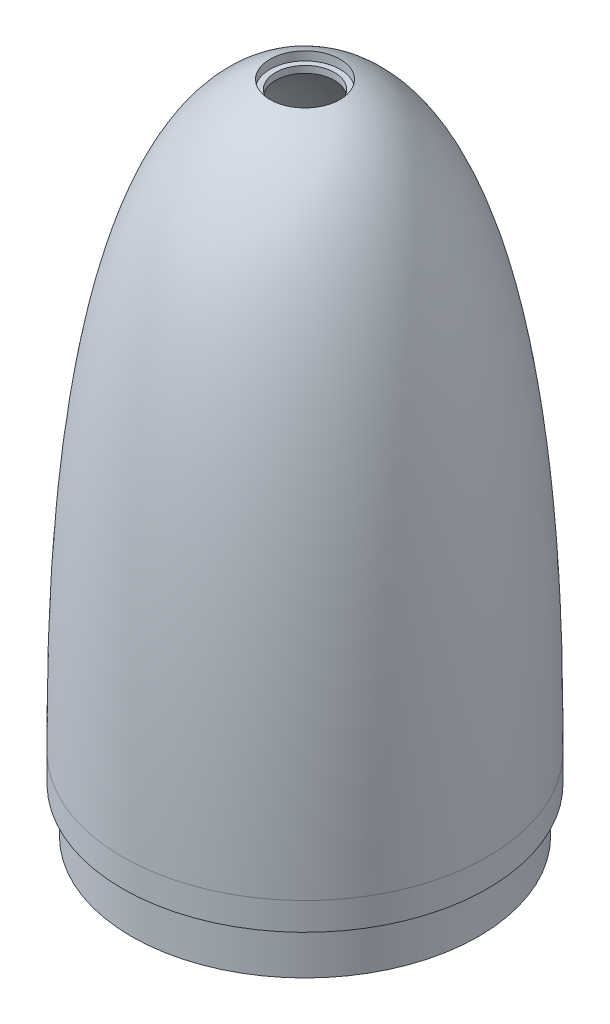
from build123d import *


with BuildPart() as part:
    # Sketch1 → Revolve1 (revolve)
    with BuildSketch(Plane.XY, mode=Mode.PRIVATE) as revolve1_sk:
        with BuildLine():
            Line((31.5, 0), (31.5, 8.3))
            Line((31.5, 8.3), (33.1, 8.3))
            Line((33.1, 8.3), (33.1, 13.3))
            add(Edge.make_bspline(
                [(0, 120), (32.549946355, 120), (33.1, 40.922620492), (33.1, 13.3)],
                knots=[0, 0, 0, 0, 1, 1, 1, 1], degree=3))
            Line((0, 120), (0, 117))
            add(Edge.make_bspline(
                [(0, 117), (0.424061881, 117), (1.283562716, 116.967183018), (2.90414984, 116.776102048), (4.827413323, 116.311450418), (6.991789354, 115.407503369), (9.735271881, 113.741670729), (12.935410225, 110.783808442), (16.392615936, 105.885181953), (19.414832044, 99.803694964), (22.848252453, 90.391390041), (26.050874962, 76.710982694), (28.020441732, 61.844611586), (29.026990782, 50.030997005), (29.541688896, 41.405212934), (29.861104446, 33.207800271), (30.002339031, 26.893701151), (30.063145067, 22.249011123), (30.088369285, 18.990454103), (30.097167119, 16.488833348), (30.099731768, 14.61208453), (30.1, 13.743148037), (30.1, 13.3)],
                knots=[0, 0, 0, 0, 0.015625, 0.03125, 0.0625, 0.09375, 0.125, 0.1875, 0.25, 0.3125, 0.375, 0.5, 0.625, 0.6875, 0.75, 0.8125, 0.875, 0.90625, 0.9375, 0.96875, 0.984375, 1, 1, 1, 1], degree=3))
            Line((30.1, 13.3), (30.1, 0))
            Line((30.1, 0), (31.5, 0))
        make_face()
    revolve(revolve1_sk.sketch.rotate(Axis((0, 120, 0), (0, -1, 0)), 90), axis=Axis((0, 120, 0), (0, -1, 0)))

    # Sketch3 → Cut-Revolve1 (revolve, cut)
    with BuildSketch(Plane.XY):
        Polygon((0, 202.97417507), (6.35, 202.97417507), (6.35, 117.304376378), (5.35, 117.304376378), (5.35, 41.717954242), (0, 41.717954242), align=None)
    revolve(axis=Axis((0, -1000, 0), (0, 1, 0)), mode=Mode.SUBTRACT)


solid = part.part
